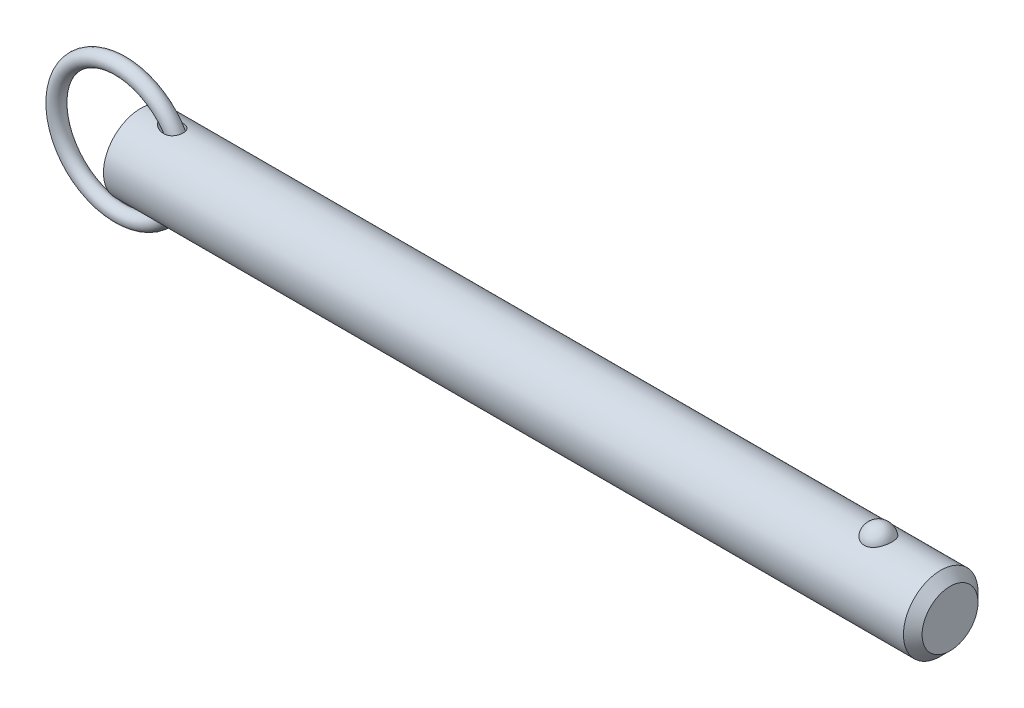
ISO-10303-21;
HEADER;
FILE_DESCRIPTION(('STEP AP214'),'2;1');
FILE_NAME('part.step','',(''),(''),'','','');
FILE_SCHEMA(('AUTOMOTIVE_DESIGN { 1 0 10303 214 1 1 1 1 }'));
ENDSEC;
DATA;
#1=APPLICATION_CONTEXT('core data for automotive mechanical design processes');
#2=APPLICATION_PROTOCOL_DEFINITION('international standard','automotive_design',2000,#1);
#3=PRODUCT_CONTEXT('',#1,'mechanical');
#4=PRODUCT('Part','Part','',(#3));
#5=PRODUCT_RELATED_PRODUCT_CATEGORY('part','',(#4));
#6=PRODUCT_DEFINITION_FORMATION('','',#4);
#7=PRODUCT_DEFINITION_CONTEXT('part definition',#1,'design');
#8=PRODUCT_DEFINITION('design','',#6,#7);
#9=PRODUCT_DEFINITION_SHAPE('','',#8);
#10=(LENGTH_UNIT() NAMED_UNIT(*) SI_UNIT(.MILLI.,.METRE.));
#11=(NAMED_UNIT(*) PLANE_ANGLE_UNIT() SI_UNIT($,.RADIAN.));
#12=(NAMED_UNIT(*) SI_UNIT($,.STERADIAN.) SOLID_ANGLE_UNIT());
#13=UNCERTAINTY_MEASURE_WITH_UNIT(LENGTH_MEASURE(1.E-05),#10,'distance_accuracy_value','');
#14=(GEOMETRIC_REPRESENTATION_CONTEXT(3) GLOBAL_UNCERTAINTY_ASSIGNED_CONTEXT((#13)) GLOBAL_UNIT_ASSIGNED_CONTEXT((#10,
#11,#12)) REPRESENTATION_CONTEXT('',''));
#15=CARTESIAN_POINT('',(0.,0.,0.));
#16=DIRECTION('',(0.,0.,1.));
#17=DIRECTION('',(1.,0.,0.));
#18=AXIS2_PLACEMENT_3D('',#15,#16,#17);
#19=CARTESIAN_POINT('',(-6.08699288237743,0.,0.));
#20=DIRECTION('',(0.,0.,1.));
#21=DIRECTION('',(1.,0.,0.));
#22=AXIS2_PLACEMENT_3D('',#19,#20,#21);
#23=TOROIDAL_SURFACE('',#22,19.05,2.223);
#24=CARTESIAN_POINT('',(15.1860071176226,0.,0.));
#25=VERTEX_POINT('',#24);
#26=VERTEX_LOOP('',#25);
#27=FACE_BOUND('',#26,.T.);
#28=ADVANCED_FACE('P0_F12',(#27),#23,.T.);
#29=CLOSED_SHELL('',(#28));
#30=MANIFOLD_SOLID_BREP('P0_B1',#29);
#31=CARTESIAN_POINT('',(0.,0.,0.));
#32=DIRECTION('',(1.,0.,0.));
#33=DIRECTION('',(0.,0.,-1.));
#34=AXIS2_PLACEMENT_3D('',#31,#32,#33);
#35=CYLINDRICAL_SURFACE('',#34,11.115);
#36=CARTESIAN_POINT('',(6.41405181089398,11.0227946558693,-1.4287136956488));
#37=CARTESIAN_POINT('',(6.49338916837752,11.0115377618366,-1.51556642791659));
#38=CARTESIAN_POINT('',(6.57765461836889,10.9998263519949,-1.59789397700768));
#39=CARTESIAN_POINT('',(6.75386647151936,10.9760304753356,-1.75391400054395));
#40=CARTESIAN_POINT('',(6.84582247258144,10.9639455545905,-1.82759540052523));
#41=CARTESIAN_POINT('',(7.03627827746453,10.9397989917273,-1.96698954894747));
#42=CARTESIAN_POINT('',(7.1348083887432,10.9277377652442,-2.03266078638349));
#43=CARTESIAN_POINT('',(7.33681032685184,10.9041015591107,-2.1558582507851));
#44=CARTESIAN_POINT('',(7.44028007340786,10.8925263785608,-2.21338786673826));
#45=CARTESIAN_POINT('',(7.64386117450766,10.8710104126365,-2.31666528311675));
#46=CARTESIAN_POINT('',(7.74368989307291,10.8610119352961,-2.36295942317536));
#47=CARTESIAN_POINT('',(7.94637195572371,10.8420168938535,-2.44863486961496));
#48=CARTESIAN_POINT('',(8.0492261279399,10.8330206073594,-2.48801426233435));
#49=CARTESIAN_POINT('',(8.3611557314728,10.807980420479,-2.59542730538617));
#50=CARTESIAN_POINT('',(8.57411849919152,10.7938278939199,-2.65299817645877));
#51=CARTESIAN_POINT('',(9.00825016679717,10.7725818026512,-2.73800108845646));
#52=CARTESIAN_POINT('',(9.22947335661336,10.7655491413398,-2.76517330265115));
#53=CARTESIAN_POINT('',(9.67368141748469,10.7605872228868,-2.78445308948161));
#54=CARTESIAN_POINT('',(9.89666486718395,10.7626512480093,-2.77658653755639));
#55=CARTESIAN_POINT('',(10.2950172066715,10.7754452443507,-2.72644436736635));
#56=CARTESIAN_POINT('',(10.4712789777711,10.7844280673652,-2.69109376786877));
#57=CARTESIAN_POINT('',(10.7292776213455,10.8024982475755,-2.61722365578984));
#58=CARTESIAN_POINT('',(10.8142337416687,10.8092901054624,-2.58911576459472));
#59=CARTESIAN_POINT('',(10.9813218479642,10.8242580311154,-2.52581287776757));
#60=CARTESIAN_POINT('',(11.0634550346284,10.8324335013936,-2.49062094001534));
#61=CARTESIAN_POINT('',(11.2247418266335,10.8500287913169,-2.41281958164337));
#62=CARTESIAN_POINT('',(11.3038694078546,10.8594572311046,-2.37015806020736));
#63=CARTESIAN_POINT('',(11.4576781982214,10.8792243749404,-2.27770403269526));
#64=CARTESIAN_POINT('',(11.5323615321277,10.8895626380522,-2.22791497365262));
#65=CARTESIAN_POINT('',(11.6765388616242,10.9108113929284,-2.12140590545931));
#66=CARTESIAN_POINT('',(11.7460329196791,10.9217218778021,-2.064685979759));
#67=CARTESIAN_POINT('',(11.8790597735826,10.9437207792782,-1.94471764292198));
#68=CARTESIAN_POINT('',(11.9425932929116,10.9548091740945,-1.88147002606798));
#69=CARTESIAN_POINT('',(12.109388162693,10.9851999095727,-1.69784918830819));
#70=CARTESIAN_POINT('',(12.205655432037,11.0042655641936,-1.57093023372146));
#71=CARTESIAN_POINT('',(12.374151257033,11.0393391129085,-1.3017676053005));
#72=CARTESIAN_POINT('',(12.4463875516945,11.0553479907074,-1.15952888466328));
#73=CARTESIAN_POINT('',(12.5615818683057,11.0816338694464,-0.871972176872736));
#74=CARTESIAN_POINT('',(12.6058896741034,11.0921698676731,-0.727217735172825));
#75=CARTESIAN_POINT('',(12.6699315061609,11.1075802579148,-0.432089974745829));
#76=CARTESIAN_POINT('',(12.6896681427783,11.1124552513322,-0.281717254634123));
#77=CARTESIAN_POINT('',(12.704022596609,11.1159901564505,0.0188164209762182));
#78=CARTESIAN_POINT('',(12.6988836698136,11.1147102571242,0.16896512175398));
#79=CARTESIAN_POINT('',(12.664168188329,11.1062126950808,0.46623811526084));
#80=CARTESIAN_POINT('',(12.6345920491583,11.0989951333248,0.613362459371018));
#81=CARTESIAN_POINT('',(12.5517453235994,11.0794095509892,0.900330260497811));
#82=CARTESIAN_POINT('',(12.4984878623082,11.0670443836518,1.04017770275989));
#83=CARTESIAN_POINT('',(12.3696588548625,11.0385082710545,1.308745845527));
#84=CARTESIAN_POINT('',(12.2940887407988,11.0223375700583,1.43746725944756));
#85=CARTESIAN_POINT('',(12.122380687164,10.987872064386,1.68079704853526));
#86=CARTESIAN_POINT('',(12.0261637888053,10.969569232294,1.79534850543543));
#87=CARTESIAN_POINT('',(11.8161707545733,10.932836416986,2.00695695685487));
#88=CARTESIAN_POINT('',(11.7023941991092,10.9144064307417,2.10401353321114));
#89=CARTESIAN_POINT('',(11.4575656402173,10.8788057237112,2.28105326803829));
#90=CARTESIAN_POINT('',(11.3261451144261,10.8616794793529,2.36053412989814));
#91=CARTESIAN_POINT('',(11.0523589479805,10.8308019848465,2.49839044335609));
#92=CARTESIAN_POINT('',(10.9099908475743,10.8170514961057,2.55676113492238));
#93=CARTESIAN_POINT('',(10.6060622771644,10.7929728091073,2.65666105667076));
#94=CARTESIAN_POINT('',(10.4438877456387,10.7830209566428,2.69640163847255));
#95=CARTESIAN_POINT('',(10.1154037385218,10.7687230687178,2.75293129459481));
#96=CARTESIAN_POINT('',(9.94909141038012,10.7643810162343,2.76970406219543));
#97=CARTESIAN_POINT('',(9.54387061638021,10.7604809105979,2.7848723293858));
#98=CARTESIAN_POINT('',(9.30446860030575,10.7637793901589,2.7722775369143));
#99=CARTESIAN_POINT('',(8.94961255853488,10.7757341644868,2.72524141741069));
#100=CARTESIAN_POINT('',(8.83186896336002,10.7808994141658,2.70482239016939));
#101=CARTESIAN_POINT('',(8.59835142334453,10.7932548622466,2.6550999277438));
#102=CARTESIAN_POINT('',(8.48257728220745,10.8004448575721,2.62579738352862));
#103=CARTESIAN_POINT('',(8.25208469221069,10.8166382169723,2.55827624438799));
#104=CARTESIAN_POINT('',(8.1374021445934,10.8256649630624,2.51994155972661));
#105=CARTESIAN_POINT('',(7.91132058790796,10.8451170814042,2.43486475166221));
#106=CARTESIAN_POINT('',(7.79992154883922,10.8555424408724,2.38812270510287));
#107=CARTESIAN_POINT('',(7.58115677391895,10.8774251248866,2.28638483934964));
#108=CARTESIAN_POINT('',(7.47378802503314,10.8888816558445,2.23139534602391));
#109=CARTESIAN_POINT('',(7.26385624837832,10.9124540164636,2.1131026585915));
#110=CARTESIAN_POINT('',(7.16129168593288,10.9245696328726,2.04980214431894));
#111=CARTESIAN_POINT('',(6.91882218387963,10.9543689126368,1.88540538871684));
#112=CARTESIAN_POINT('',(6.78193778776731,10.9721958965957,1.77979827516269));
#113=CARTESIAN_POINT('',(6.52472441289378,11.0070222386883,1.54989693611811));
#114=CARTESIAN_POINT('',(6.40436902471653,11.0240228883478,1.42563320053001));
#115=CARTESIAN_POINT('',(6.2183880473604,11.0509658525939,1.19529359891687));
#116=CARTESIAN_POINT('',(6.14691885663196,11.0615430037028,1.09404520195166));
#117=CARTESIAN_POINT('',(6.0204349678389,11.0805004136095,0.881508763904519));
#118=CARTESIAN_POINT('',(5.96539400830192,11.0888841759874,0.770237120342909));
#119=CARTESIAN_POINT('',(5.88475453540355,11.1012553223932,0.560577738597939));
#120=CARTESIAN_POINT('',(5.85559643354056,11.1057686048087,0.463603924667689));
#121=CARTESIAN_POINT('',(5.8138129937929,11.1122523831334,0.266083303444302));
#122=CARTESIAN_POINT('',(5.80117118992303,11.1142254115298,0.16554015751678));
#123=CARTESIAN_POINT('',(5.79363815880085,11.1153999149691,-0.0364747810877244));
#124=CARTESIAN_POINT('',(5.79878799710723,11.1145949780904,-0.137948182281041));
#125=CARTESIAN_POINT('',(5.82639592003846,11.1102987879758,-0.338493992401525));
#126=CARTESIAN_POINT('',(5.8488723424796,11.1068046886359,-0.437563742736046));
#127=CARTESIAN_POINT('',(5.91510741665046,11.0965857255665,-0.649968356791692));
#128=CARTESIAN_POINT('',(5.96220905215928,11.0893566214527,-0.762222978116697));
#129=CARTESIAN_POINT('',(6.07378449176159,11.072471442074,-0.97739679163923));
#130=CARTESIAN_POINT('',(6.13826787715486,11.0628140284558,-1.08031079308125));
#131=CARTESIAN_POINT('',(6.24101077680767,11.0477136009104,-1.22195806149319));
#132=CARTESIAN_POINT('',(6.27403486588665,11.042895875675,-1.26469183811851));
#133=CARTESIAN_POINT('',(6.3423802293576,11.0330152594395,-1.34817011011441));
#134=CARTESIAN_POINT('',(6.37769867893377,11.0279526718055,-1.38891694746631));
#135=CARTESIAN_POINT('',(6.41405181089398,11.0227946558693,-1.4287136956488));
#136=B_SPLINE_CURVE_WITH_KNOTS('',3,(#36,#37,#38,#39,#40,#41,#42,#43,#44,#45,#46,#47,#48,#49,
#50,#51,#52,#53,#54,#55,#56,#57,#58,#59,#60,#61,#62,#63,#64,#65,#66,#67,#68,#69,#70,#71,#72,#73,
#74,#75,#76,#77,#78,#79,#80,#81,#82,#83,#84,#85,#86,#87,#88,#89,#90,#91,#92,#93,#94,#95,#96,#97,
#98,#99,#100,#101,#102,#103,#104,#105,#106,#107,#108,#109,#110,#111,#112,#113,#114,#115,#116,
#117,#118,#119,#120,#121,#122,#123,#124,#125,#126,#127,#128,#129,#130,#131,#132,#133,#134,#135),
.UNSPECIFIED.,.T.,.F.,(4,2,2,2,2,2,2,2,2,2,2,2,2,2,2,2,2,2,2,2,2,2,2,2,2,2,2,2,2,2,2,2,2,2,2,2,
2,2,2,2,2,2,2,2,2,2,2,2,2,4),(0.,0.35443329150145,0.709315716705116,1.0659654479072,
1.42246628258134,1.7536715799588,2.08496839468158,2.74582009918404,3.41227815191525,
4.07824412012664,4.61583787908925,4.88478112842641,5.15360853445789,5.42439170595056,
5.69504436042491,5.96569375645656,6.23631025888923,6.71490729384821,7.1933500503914,
7.64641437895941,8.09943057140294,8.54802575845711,8.99661331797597,9.44495256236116,
9.89326303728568,10.3433195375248,10.7933867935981,11.2550086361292,11.7167345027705,
12.2165866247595,12.7167934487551,13.4318876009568,13.7904664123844,14.1490092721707,
14.5124394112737,14.8758662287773,15.239015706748,15.6020483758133,16.1219860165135,
16.6410830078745,17.0130520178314,17.3844231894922,17.6872330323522,17.9897407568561,
18.2929471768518,18.5964749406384,18.9603532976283,19.3244326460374,19.4870338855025,
19.649438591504),.UNSPECIFIED.);
#137=CARTESIAN_POINT('',(6.41405181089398,11.0227946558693,-1.4287136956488));
#138=VERTEX_POINT('',#137);
#139=EDGE_CURVE('P1_E40',#138,#138,#136,.T.);
#140=ORIENTED_EDGE('',*,*,#139,.T.);
#141=EDGE_LOOP('',(#140));
#142=FACE_BOUND('',#141,.T.);
#143=CARTESIAN_POINT('',(238.52125,0.,0.));
#144=DIRECTION('',(1.,0.,0.));
#145=DIRECTION('',(0.,0.,-1.));
#146=AXIS2_PLACEMENT_3D('',#143,#144,#145);
#147=CIRCLE('',#146,11.115);
#148=CARTESIAN_POINT('',(238.52125,0.,-11.115));
#149=VERTEX_POINT('',#148);
#150=EDGE_CURVE('P1_E25',#149,#149,#147,.T.);
#151=ORIENTED_EDGE('',*,*,#150,.F.);
#152=EDGE_LOOP('',(#151));
#153=FACE_BOUND('',#152,.T.);
#154=CARTESIAN_POINT('',(0.,0.,0.));
#155=DIRECTION('',(1.,0.,0.));
#156=DIRECTION('',(0.,0.,-1.));
#157=AXIS2_PLACEMENT_3D('',#154,#155,#156);
#158=CIRCLE('',#157,11.115);
#159=CARTESIAN_POINT('',(0.,0.,-11.115));
#160=VERTEX_POINT('',#159);
#161=EDGE_CURVE('P1_E9',#160,#160,#158,.T.);
#162=ORIENTED_EDGE('',*,*,#161,.T.);
#163=EDGE_LOOP('',(#162));
#164=FACE_BOUND('',#163,.T.);
#165=CARTESIAN_POINT('',(219.931068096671,10.3028087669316,4.17077409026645));
#166=CARTESIAN_POINT('',(219.714775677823,10.3028003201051,4.17078240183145));
#167=CARTESIAN_POINT('',(219.498548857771,10.3098895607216,4.15340593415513));
#168=CARTESIAN_POINT('',(219.072540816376,10.3373834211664,4.08449540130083));
#169=CARTESIAN_POINT('',(218.862757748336,10.3577841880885,4.0329712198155));
#170=CARTESIAN_POINT('',(218.455782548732,10.4095237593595,3.89746513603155));
#171=CARTESIAN_POINT('',(218.258572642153,10.4408466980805,3.81353029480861));
#172=CARTESIAN_POINT('',(217.881338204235,10.5110236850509,3.61560339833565));
#173=CARTESIAN_POINT('',(217.701317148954,10.5498792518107,3.50160528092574));
#174=CARTESIAN_POINT('',(217.357684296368,10.6322884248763,3.24292464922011));
#175=CARTESIAN_POINT('',(217.194686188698,10.6759443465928,3.09746040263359));
#176=CARTESIAN_POINT('',(216.894591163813,10.7625291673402,2.7817192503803));
#177=CARTESIAN_POINT('',(216.757499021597,10.8054579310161,2.61143778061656));
#178=CARTESIAN_POINT('',(216.506408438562,10.8881935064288,2.24226695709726));
#179=CARTESIAN_POINT('',(216.393710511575,10.9277761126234,2.04244123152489));
#180=CARTESIAN_POINT('',(216.201777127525,10.997484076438,1.62578254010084));
#181=CARTESIAN_POINT('',(216.122544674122,11.0276085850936,1.40894804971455));
#182=CARTESIAN_POINT('',(215.998303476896,11.0756732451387,0.961250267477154));
#183=CARTESIAN_POINT('',(215.953760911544,11.0934470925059,0.730239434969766));
#184=CARTESIAN_POINT('',(215.901569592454,11.1143331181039,0.263439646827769));
#185=CARTESIAN_POINT('',(215.893920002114,11.1174456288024,0.0276507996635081));
#186=CARTESIAN_POINT('',(215.91561056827,11.1087161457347,-0.440729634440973));
#187=CARTESIAN_POINT('',(215.944762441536,11.0969502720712,-0.6733313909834));
#188=CARTESIAN_POINT('',(216.039143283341,11.0597872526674,-1.12996621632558));
#189=CARTESIAN_POINT('',(216.104372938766,11.0343898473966,-1.35399912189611));
#190=CARTESIAN_POINT('',(216.26969844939,10.972515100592,-1.78750286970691));
#191=CARTESIAN_POINT('',(216.36983863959,10.9360236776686,-1.99695478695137));
#192=CARTESIAN_POINT('',(216.602940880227,10.8557595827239,-2.39520667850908));
#193=CARTESIAN_POINT('',(216.735905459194,10.8119863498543,-2.58400506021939));
#194=CARTESIAN_POINT('',(217.032407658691,10.7216733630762,-2.93635726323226));
#195=CARTESIAN_POINT('',(217.196056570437,10.675123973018,-3.09981510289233));
#196=CARTESIAN_POINT('',(217.549860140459,10.5846571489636,-3.39592247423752));
#197=CARTESIAN_POINT('',(217.740012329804,10.5407394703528,-3.52857487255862));
#198=CARTESIAN_POINT('',(218.13750141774,10.4616690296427,-3.75646057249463));
#199=CARTESIAN_POINT('',(218.34436705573,10.4263443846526,-3.85245432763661));
#200=CARTESIAN_POINT('',(218.772954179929,10.3675574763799,-4.00798747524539));
#201=CARTESIAN_POINT('',(218.994670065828,10.344090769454,-4.0675405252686));
#202=CARTESIAN_POINT('',(219.434669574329,10.3128282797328,-4.14614314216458));
#203=CARTESIAN_POINT('',(219.652565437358,10.3043040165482,-4.1670783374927));
#204=CARTESIAN_POINT('',(220.08894951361,10.3016771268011,-4.17357158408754));
#205=CARTESIAN_POINT('',(220.307437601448,10.3075716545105,-4.15913661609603));
#206=CARTESIAN_POINT('',(220.731744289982,10.3326686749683,-4.09636961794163));
#207=CARTESIAN_POINT('',(220.937745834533,10.3514555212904,-4.0490957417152));
#208=CARTESIAN_POINT('',(221.338576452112,10.399818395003,-3.92320197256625));
#209=CARTESIAN_POINT('',(221.5334046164,10.4293952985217,-3.84457953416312));
#210=CARTESIAN_POINT('',(221.911191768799,10.4969600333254,-3.65612410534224));
#211=CARTESIAN_POINT('',(222.093797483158,10.5351178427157,-3.54564545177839));
#212=CARTESIAN_POINT('',(222.438204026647,10.6154999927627,-3.29718036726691));
#213=CARTESIAN_POINT('',(222.600000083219,10.657725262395,-3.15918764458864));
#214=CARTESIAN_POINT('',(222.906959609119,10.744212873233,-2.85163580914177));
#215=CARTESIAN_POINT('',(223.050891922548,10.7884718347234,-2.68084605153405));
#216=CARTESIAN_POINT('',(223.309237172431,10.872374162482,-2.31721864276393));
#217=CARTESIAN_POINT('',(223.423644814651,10.9120167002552,-2.12437704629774));
#218=CARTESIAN_POINT('',(223.623873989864,10.9838919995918,-1.71516999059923));
#219=CARTESIAN_POINT('',(223.70866178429,11.0158465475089,-1.49824866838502));
#220=CARTESIAN_POINT('',(223.84268382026,11.0673523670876,-1.05228572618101));
#221=CARTESIAN_POINT('',(223.891917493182,11.086903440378,-0.823243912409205));
#222=CARTESIAN_POINT('',(223.953891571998,11.1116323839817,-0.359087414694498));
#223=CARTESIAN_POINT('',(223.966566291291,11.1167843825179,-0.12396256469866));
#224=CARTESIAN_POINT('',(223.954973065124,11.1121144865,0.345220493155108));
#225=CARTESIAN_POINT('',(223.930705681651,11.1022928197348,0.579278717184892));
#226=CARTESIAN_POINT('',(223.845907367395,11.0687504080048,1.03866534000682));
#227=CARTESIAN_POINT('',(223.785529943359,11.0450885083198,1.26402641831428));
#228=CARTESIAN_POINT('',(223.629853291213,10.9863185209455,1.70076772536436));
#229=CARTESIAN_POINT('',(223.534551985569,10.9512097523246,1.91214712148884));
#230=CARTESIAN_POINT('',(223.310397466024,10.8729733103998,2.316083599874));
#231=CARTESIAN_POINT('',(223.181380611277,10.8298068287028,2.50854240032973));
#232=CARTESIAN_POINT('',(222.892732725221,10.7401896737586,2.86808766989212));
#233=CARTESIAN_POINT('',(222.733102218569,10.6937390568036,3.03517457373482));
#234=CARTESIAN_POINT('',(222.387534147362,10.6029321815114,3.33857581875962));
#235=CARTESIAN_POINT('',(222.201708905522,10.5585680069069,3.47501541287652));
#236=CARTESIAN_POINT('',(221.807875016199,10.4769321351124,3.71390897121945));
#237=CARTESIAN_POINT('',(221.599863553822,10.439661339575,3.81635861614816));
#238=CARTESIAN_POINT('',(221.154066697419,10.3749407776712,3.98910631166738));
#239=CARTESIAN_POINT('',(220.915234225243,10.3482457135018,4.05700929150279));
#240=CARTESIAN_POINT('',(220.427925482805,10.312188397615,4.14782844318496));
#241=CARTESIAN_POINT('',(220.179453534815,10.3028184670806,4.17076454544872));
#242=CARTESIAN_POINT('',(219.931068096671,10.3028087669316,4.17077409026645));
#243=B_SPLINE_CURVE_WITH_KNOTS('',3,(#165,#166,#167,#168,#169,#170,#171,#172,#173,#174,#175,
#176,#177,#178,#179,#180,#181,#182,#183,#184,#185,#186,#187,#188,#189,#190,#191,#192,#193,#194,
#195,#196,#197,#198,#199,#200,#201,#202,#203,#204,#205,#206,#207,#208,#209,#210,#211,#212,#213,
#214,#215,#216,#217,#218,#219,#220,#221,#222,#223,#224,#225,#226,#227,#228,#229,#230,#231,#232,
#233,#234,#235,#236,#237,#238,#239,#240,#241,#242),.UNSPECIFIED.,.T.,.F.,(4,2,2,2,2,2,2,2,2,2,2,
2,2,2,2,2,2,2,2,2,2,2,2,2,2,2,2,2,2,2,2,2,2,2,2,2,2,2,4),(0.,0.64796614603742,1.29574482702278,
1.94258643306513,2.58955857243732,3.25496465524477,3.92049326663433,4.61566368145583,
5.31089647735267,6.01531821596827,6.71972398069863,7.42054043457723,8.12137023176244,
8.82309331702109,9.52487047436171,10.2292439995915,10.9335519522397,11.6223330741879,
12.3108558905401,12.9647664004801,13.6185478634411,14.252184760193,14.8858731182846,
15.5334360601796,16.1811472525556,16.8611459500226,17.5412664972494,18.2431855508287,
18.9451158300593,19.6483065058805,20.3514864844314,21.0516982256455,21.7519516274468,
22.4556690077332,23.1593743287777,23.860149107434,24.5610129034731,25.3054529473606,
26.049562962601),.UNSPECIFIED.);
#244=CARTESIAN_POINT('',(219.931068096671,10.3028087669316,4.17077409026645));
#245=VERTEX_POINT('',#244);
#246=EDGE_CURVE('P1_E34',#245,#245,#243,.T.);
#247=ORIENTED_EDGE('',*,*,#246,.T.);
#248=EDGE_LOOP('',(#247));
#249=FACE_BOUND('',#248,.T.);
#250=CARTESIAN_POINT('',(6.41405181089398,-11.0227946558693,-1.4287136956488));
#251=CARTESIAN_POINT('',(6.33124061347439,-11.0345445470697,-1.33806125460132));
#252=CARTESIAN_POINT('',(6.25372866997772,-11.0458090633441,-1.24240732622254));
#253=CARTESIAN_POINT('',(6.11277905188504,-11.0666115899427,-1.04095704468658));
#254=CARTESIAN_POINT('',(6.04933920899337,-11.0761498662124,-0.935162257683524));
#255=CARTESIAN_POINT('',(5.94029181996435,-11.0927063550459,-0.712476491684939));
#256=CARTESIAN_POINT('',(5.89492964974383,-11.0996897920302,-0.595457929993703));
#257=CARTESIAN_POINT('',(5.84498161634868,-11.1074141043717,-0.414997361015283));
#258=CARTESIAN_POINT('',(5.83135004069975,-11.1095300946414,-0.354047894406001));
#259=CARTESIAN_POINT('',(5.81051649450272,-11.1127688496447,-0.231041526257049));
#260=CARTESIAN_POINT('',(5.80331311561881,-11.1138918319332,-0.168984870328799));
#261=CARTESIAN_POINT('',(5.79296529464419,-11.1155042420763,-0.000484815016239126));
#262=CARTESIAN_POINT('',(5.79625267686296,-11.1149904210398,0.106437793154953));
#263=CARTESIAN_POINT('',(5.82213676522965,-11.1109609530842,0.317809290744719));
#264=CARTESIAN_POINT('',(5.84474662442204,-11.1074432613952,0.422256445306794));
#265=CARTESIAN_POINT('',(5.91113114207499,-11.097197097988,0.63936180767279));
#266=CARTESIAN_POINT('',(5.95733120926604,-11.090102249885,0.75125097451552));
#267=CARTESIAN_POINT('',(6.06709542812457,-11.0734770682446,0.965912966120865));
#268=CARTESIAN_POINT('',(6.13068735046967,-11.06394284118,1.06867085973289));
#269=CARTESIAN_POINT('',(6.30294237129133,-11.0385920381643,1.30890635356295));
#270=CARTESIAN_POINT('',(6.41896200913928,-11.0218881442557,1.44097376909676));
#271=CARTESIAN_POINT('',(6.6698965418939,-10.9871512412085,1.68553954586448));
#272=CARTESIAN_POINT('',(6.80485520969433,-10.9691152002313,1.79799117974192));
#273=CARTESIAN_POINT('',(7.04881236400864,-10.9382283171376,1.97587596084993));
#274=CARTESIAN_POINT('',(7.15465712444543,-10.9253240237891,2.04570822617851));
#275=CARTESIAN_POINT('',(7.37202504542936,-10.9000987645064,2.17611840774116));
#276=CARTESIAN_POINT('',(7.48355057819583,-10.8877780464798,2.23669241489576));
#277=CARTESIAN_POINT('',(7.71132418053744,-10.8641580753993,2.34873831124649));
#278=CARTESIAN_POINT('',(7.82757727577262,-10.8528599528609,2.40020018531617));
#279=CARTESIAN_POINT('',(8.06386825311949,-10.8317234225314,2.49385169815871));
#280=CARTESIAN_POINT('',(8.18390558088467,-10.8218848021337,2.53604268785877));
#281=CARTESIAN_POINT('',(8.42918336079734,-10.8039208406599,2.61152283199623));
#282=CARTESIAN_POINT('',(8.55447802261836,-10.7958283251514,2.64464414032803));
#283=CARTESIAN_POINT('',(8.80752127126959,-10.781995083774,2.70048793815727));
#284=CARTESIAN_POINT('',(8.93527019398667,-10.7762546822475,2.72320899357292));
#285=CARTESIAN_POINT('',(9.1921017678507,-10.7675291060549,2.75750994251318));
#286=CARTESIAN_POINT('',(9.32118105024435,-10.7645381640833,2.76911315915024));
#287=CARTESIAN_POINT('',(9.57984338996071,-10.761622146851,2.78042035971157));
#288=CARTESIAN_POINT('',(9.70942621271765,-10.7616957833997,2.78012934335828));
#289=CARTESIAN_POINT('',(10.0243125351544,-10.7659059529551,2.76381534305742));
#290=CARTESIAN_POINT('',(10.209307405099,-10.7717977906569,2.74099674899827));
#291=CARTESIAN_POINT('',(10.5731188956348,-10.7905408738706,2.66626238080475));
#292=CARTESIAN_POINT('',(10.7519389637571,-10.8033881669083,2.61436313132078));
#293=CARTESIAN_POINT('',(11.0114289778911,-10.8271584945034,2.51336808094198));
#294=CARTESIAN_POINT('',(11.096831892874,-10.835881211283,2.47562331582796));
#295=CARTESIAN_POINT('',(11.2636000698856,-10.8545688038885,2.39236170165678));
#296=CARTESIAN_POINT('',(11.3449673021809,-10.8645330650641,2.3468486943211));
#297=CARTESIAN_POINT('',(11.5027832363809,-10.8853818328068,2.24815967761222));
#298=CARTESIAN_POINT('',(11.5792327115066,-10.8962661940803,2.19498487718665));
#299=CARTESIAN_POINT('',(11.7263315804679,-10.9185541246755,2.08128855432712));
#300=CARTESIAN_POINT('',(11.7969818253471,-10.9299576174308,2.02076811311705));
#301=CARTESIAN_POINT('',(11.9817953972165,-10.9613645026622,1.84513663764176));
#302=CARTESIAN_POINT('',(12.0893012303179,-10.9814643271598,1.72286660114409));
#303=CARTESIAN_POINT('',(12.2803576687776,-11.0193991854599,1.46066991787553));
#304=CARTESIAN_POINT('',(12.3639173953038,-11.0372350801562,1.3207500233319));
#305=CARTESIAN_POINT('',(12.4996220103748,-11.0672969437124,1.03778067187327));
#306=CARTESIAN_POINT('',(12.5535315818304,-11.0798242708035,0.895607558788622));
#307=CARTESIAN_POINT('',(12.636874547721,-11.0995427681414,0.603918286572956));
#308=CARTESIAN_POINT('',(12.6663115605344,-11.1067347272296,0.454403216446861));
#309=CARTESIAN_POINT('',(12.6997387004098,-11.1149224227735,0.154577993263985));
#310=CARTESIAN_POINT('',(12.7040886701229,-11.1160057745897,0.00431019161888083));
#311=CARTESIAN_POINT('',(12.6882048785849,-11.1120956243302,-0.294841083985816));
#312=CARTESIAN_POINT('',(12.6679715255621,-11.1071022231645,-0.443724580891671));
#313=CARTESIAN_POINT('',(12.6034470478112,-11.0915888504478,-0.735688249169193));
#314=CARTESIAN_POINT('',(12.5591858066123,-11.0810757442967,-0.878775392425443));
#315=CARTESIAN_POINT('',(12.4477416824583,-11.0556687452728,-1.15529525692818));
#316=CARTESIAN_POINT('',(12.3805601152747,-11.0407751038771,-1.28872853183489));
#317=CARTESIAN_POINT('',(12.2248919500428,-11.0081839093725,-1.54257976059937));
#318=CARTESIAN_POINT('',(12.1363549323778,-10.9904797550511,-1.66296592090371));
#319=CARTESIAN_POINT('',(11.9406137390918,-10.9541951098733,-1.88726577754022));
#320=CARTESIAN_POINT('',(11.833409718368,-10.9356146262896,-1.9911796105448));
#321=CARTESIAN_POINT('',(11.601318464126,-10.8991360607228,-2.18213646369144));
#322=CARTESIAN_POINT('',(11.4761325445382,-10.8812577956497,-2.26881927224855));
#323=CARTESIAN_POINT('',(11.2134852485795,-10.8482871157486,-2.42157282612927));
#324=CARTESIAN_POINT('',(11.0760218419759,-10.8331951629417,-2.48764015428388));
#325=CARTESIAN_POINT('',(10.7828968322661,-10.8061050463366,-2.60290068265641));
#326=CARTESIAN_POINT('',(10.6266338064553,-10.7943907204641,-2.65062248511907));
#327=CARTESIAN_POINT('',(10.3086617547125,-10.7762429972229,-2.72345054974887));
#328=CARTESIAN_POINT('',(10.146948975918,-10.7698133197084,-2.74854088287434));
#329=CARTESIAN_POINT('',(9.75541304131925,-10.7608036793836,-2.78368719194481));
#330=CARTESIAN_POINT('',(9.52459435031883,-10.7608467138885,-2.78350276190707));
#331=CARTESIAN_POINT('',(9.0660496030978,-10.7702674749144,-2.74677945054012));
#332=CARTESIAN_POINT('',(8.83832966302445,-10.7796615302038,-2.71017697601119));
#333=CARTESIAN_POINT('',(8.38783466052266,-10.8058248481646,-2.60392490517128));
#334=CARTESIAN_POINT('',(8.16517101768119,-10.8226939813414,-2.53382676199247));
#335=CARTESIAN_POINT('',(7.84087311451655,-10.8516548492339,-2.40555545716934));
#336=CARTESIAN_POINT('',(7.73435551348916,-10.8619221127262,-2.35892455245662));
#337=CARTESIAN_POINT('',(7.52510420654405,-10.883357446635,-2.25797017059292));
#338=CARTESIAN_POINT('',(7.42236986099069,-10.8945253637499,-2.20364800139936));
#339=CARTESIAN_POINT('',(7.23808758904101,-10.915528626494,-2.09688018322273));
#340=CARTESIAN_POINT('',(7.15584631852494,-10.9252787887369,-2.0456107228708));
#341=CARTESIAN_POINT('',(6.99510576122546,-10.944960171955,-1.93754729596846));
#342=CARTESIAN_POINT('',(6.91660574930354,-10.9548913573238,-1.88075440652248));
#343=CARTESIAN_POINT('',(6.76418133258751,-10.974690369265,-1.76154504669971));
#344=CARTESIAN_POINT('',(6.69024940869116,-10.9845582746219,-1.6991382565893));
#345=CARTESIAN_POINT('',(6.54780119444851,-11.0039826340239,-1.56842485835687));
#346=CARTESIAN_POINT('',(6.47928247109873,-11.0135392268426,-1.50012092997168));
#347=CARTESIAN_POINT('',(6.41405181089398,-11.0227946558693,-1.4287136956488));
#348=B_SPLINE_CURVE_WITH_KNOTS('',3,(#250,#251,#252,#253,#254,#255,#256,#257,#258,#259,#260,
#261,#262,#263,#264,#265,#266,#267,#268,#269,#270,#271,#272,#273,#274,#275,#276,#277,#278,#279,
#280,#281,#282,#283,#284,#285,#286,#287,#288,#289,#290,#291,#292,#293,#294,#295,#296,#297,#298,
#299,#300,#301,#302,#303,#304,#305,#306,#307,#308,#309,#310,#311,#312,#313,#314,#315,#316,#317,
#318,#319,#320,#321,#322,#323,#324,#325,#326,#327,#328,#329,#330,#331,#332,#333,#334,#335,#336,
#337,#338,#339,#340,#341,#342,#343,#344,#345,#346,#347),.UNSPECIFIED.,.T.,.F.,(4,2,2,2,2,2,2,2,
2,2,2,2,2,2,2,2,2,2,2,2,2,2,2,2,2,2,2,2,2,2,2,2,2,2,2,2,2,2,2,2,2,2,2,2,2,2,2,2,4),(0.,
0.36983565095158,0.739614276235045,1.1142538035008,1.30141910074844,1.48854338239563,
1.8074587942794,2.12659146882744,2.4883888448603,2.85076733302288,3.3776216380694,
3.90571433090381,4.287639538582,4.66972556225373,5.05222896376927,5.43467659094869,
5.82378546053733,6.21294796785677,6.60129228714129,6.9894733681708,7.54669558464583,
8.10360148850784,8.38458539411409,8.66543074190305,8.94623182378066,9.22699162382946,
9.7162888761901,10.2053995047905,10.6608871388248,11.1163074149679,11.5651786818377,
12.0140424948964,12.4623493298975,12.9106304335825,13.3599804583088,13.8093267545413,
14.2672570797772,14.7252632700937,15.214740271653,15.7045615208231,16.3932594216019,
17.083162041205,17.7825738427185,18.1325177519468,18.4824022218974,18.7744056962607,
19.0663523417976,19.3578048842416,19.6491256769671),.UNSPECIFIED.);
#349=CARTESIAN_POINT('',(6.41405181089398,-11.0227946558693,-1.4287136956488));
#350=VERTEX_POINT('',#349);
#351=EDGE_CURVE('P1_E17',#350,#350,#348,.T.);
#352=ORIENTED_EDGE('',*,*,#351,.T.);
#353=EDGE_LOOP('',(#352));
#354=FACE_BOUND('',#353,.T.);
#355=ADVANCED_FACE('P1_F13',(#142,#153,#164,#249,#354),#35,.T.);
#356=CARTESIAN_POINT('',(0.,0.,0.));
#357=DIRECTION('',(-1.,0.,0.));
#358=DIRECTION('',(0.,0.,1.));
#359=AXIS2_PLACEMENT_3D('',#356,#357,#358);
#360=PLANE('',#359);
#361=ORIENTED_EDGE('',*,*,#161,.F.);
#362=EDGE_LOOP('',(#361));
#363=FACE_BOUND('',#362,.T.);
#364=ADVANCED_FACE('P1_F15',(#363),#360,.T.);
#365=CARTESIAN_POINT('',(241.3,0.,0.));
#366=DIRECTION('',(-1.,0.,0.));
#367=DIRECTION('',(0.,0.,1.));
#368=AXIS2_PLACEMENT_3D('',#365,#366,#367);
#369=CONICAL_SURFACE('',#368,8.33625000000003,0.785398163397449);
#370=ORIENTED_EDGE('',*,*,#150,.T.);
#371=EDGE_LOOP('',(#370));
#372=FACE_BOUND('',#371,.T.);
#373=CARTESIAN_POINT('',(241.3,0.,0.));
#374=DIRECTION('',(1.,0.,0.));
#375=DIRECTION('',(0.,0.,-1.));
#376=AXIS2_PLACEMENT_3D('',#373,#374,#375);
#377=CIRCLE('',#376,8.33625000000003);
#378=CARTESIAN_POINT('',(241.3,0.,-8.33625000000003));
#379=VERTEX_POINT('',#378);
#380=EDGE_CURVE('P1_E30',#379,#379,#377,.T.);
#381=ORIENTED_EDGE('',*,*,#380,.F.);
#382=EDGE_LOOP('',(#381));
#383=FACE_BOUND('',#382,.T.);
#384=ADVANCED_FACE('P1_F55',(#372,#383),#369,.T.);
#385=CARTESIAN_POINT('',(241.3,8.33625000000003,0.));
#386=DIRECTION('',(1.,0.,0.));
#387=DIRECTION('',(0.,0.,-1.));
#388=AXIS2_PLACEMENT_3D('',#385,#386,#387);
#389=PLANE('',#388);
#390=ORIENTED_EDGE('',*,*,#380,.T.);
#391=EDGE_LOOP('',(#390));
#392=FACE_BOUND('',#391,.T.);
#393=ADVANCED_FACE('P1_F51',(#392),#389,.T.);
#394=CARTESIAN_POINT('',(219.931068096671,10.0035,0.));
#395=DIRECTION('',(-1.,0.,0.));
#396=DIRECTION('',(0.,1.,0.));
#397=AXIS2_PLACEMENT_3D('',#394,#395,#396);
#398=SPHERICAL_SURFACE('',#397,4.18150000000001);
#399=ORIENTED_EDGE('',*,*,#246,.F.);
#400=EDGE_LOOP('',(#399));
#401=FACE_BOUND('',#400,.T.);
#402=ADVANCED_FACE('P1_F46',(#401),#398,.T.);
#403=CARTESIAN_POINT('',(-6.08699288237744,0.,0.));
#404=DIRECTION('',(0.,0.,1.));
#405=DIRECTION('',(1.,0.,0.));
#406=AXIS2_PLACEMENT_3D('',#403,#404,#405);
#407=TOROIDAL_SURFACE('',#406,19.05,2.77875);
#408=ORIENTED_EDGE('',*,*,#351,.F.);
#409=EDGE_LOOP('',(#408));
#410=FACE_BOUND('',#409,.T.);
#411=ORIENTED_EDGE('',*,*,#139,.F.);
#412=EDGE_LOOP('',(#411));
#413=FACE_BOUND('',#412,.T.);
#414=ADVANCED_FACE('P1_F50',(#410,#413),#407,.F.);
#415=CLOSED_SHELL('',(#355,#364,#384,#393,#402,#414));
#416=MANIFOLD_SOLID_BREP('P1_B1',#415);
#417=ADVANCED_BREP_SHAPE_REPRESENTATION('',(#18,#30,#416),#14);
#418=SHAPE_DEFINITION_REPRESENTATION(#9,#417);
ENDSEC;
END-ISO-10303-21;
